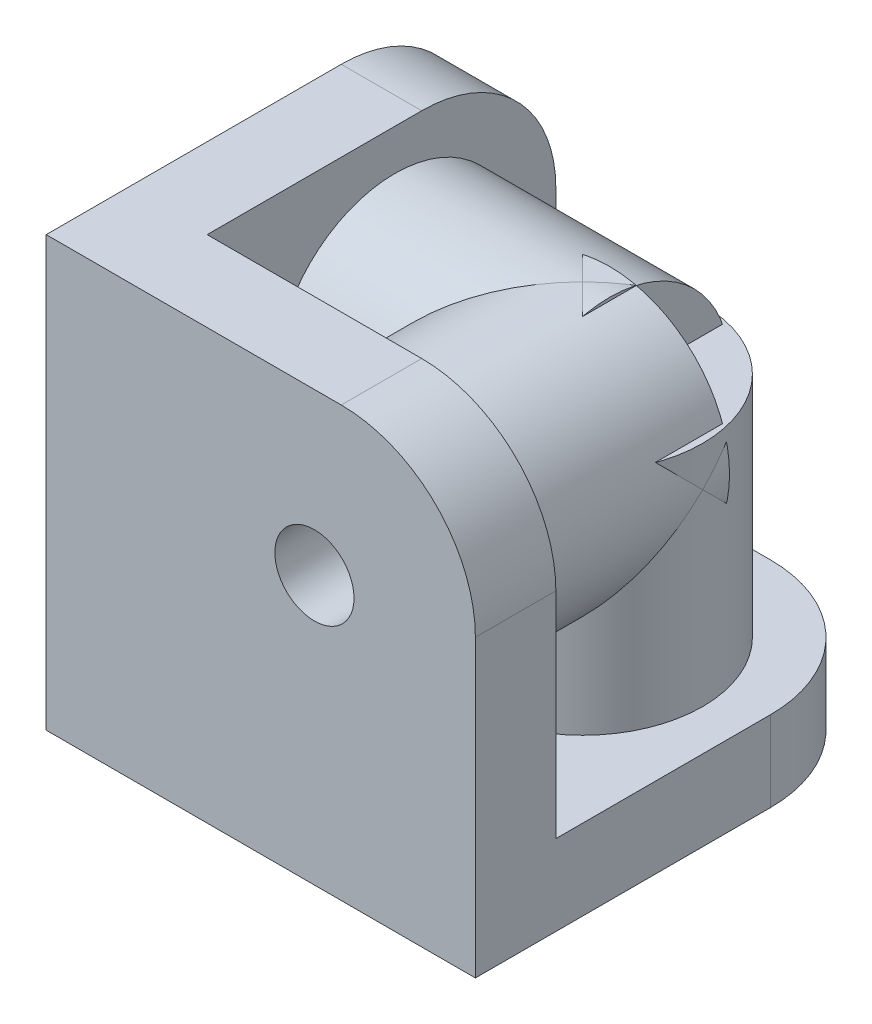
ISO-10303-21;
HEADER;
FILE_DESCRIPTION(('STEP AP214'),'2;1');
FILE_NAME('part.step','',(''),(''),'','','');
FILE_SCHEMA(('AUTOMOTIVE_DESIGN { 1 0 10303 214 1 1 1 1 }'));
ENDSEC;
DATA;
#1=APPLICATION_CONTEXT('core data for automotive mechanical design processes');
#2=APPLICATION_PROTOCOL_DEFINITION('international standard','automotive_design',2000,#1);
#3=PRODUCT_CONTEXT('',#1,'mechanical');
#4=PRODUCT('Part','Part','',(#3));
#5=PRODUCT_RELATED_PRODUCT_CATEGORY('part','',(#4));
#6=PRODUCT_DEFINITION_FORMATION('','',#4);
#7=PRODUCT_DEFINITION_CONTEXT('part definition',#1,'design');
#8=PRODUCT_DEFINITION('design','',#6,#7);
#9=PRODUCT_DEFINITION_SHAPE('','',#8);
#10=(LENGTH_UNIT() NAMED_UNIT(*) SI_UNIT(.MILLI.,.METRE.));
#11=(NAMED_UNIT(*) PLANE_ANGLE_UNIT() SI_UNIT($,.RADIAN.));
#12=(NAMED_UNIT(*) SI_UNIT($,.STERADIAN.) SOLID_ANGLE_UNIT());
#13=UNCERTAINTY_MEASURE_WITH_UNIT(LENGTH_MEASURE(1.E-05),#10,'distance_accuracy_value','');
#14=(GEOMETRIC_REPRESENTATION_CONTEXT(3) GLOBAL_UNCERTAINTY_ASSIGNED_CONTEXT((#13)) GLOBAL_UNIT_ASSIGNED_CONTEXT((#10,
#11,#12)) REPRESENTATION_CONTEXT('',''));
#15=CARTESIAN_POINT('',(0.,0.,0.));
#16=DIRECTION('',(0.,0.,1.));
#17=DIRECTION('',(1.,0.,0.));
#18=AXIS2_PLACEMENT_3D('',#15,#16,#17);
#19=CARTESIAN_POINT('',(0.,16.,-16.));
#20=DIRECTION('',(0.,1.,0.));
#21=DIRECTION('',(0.,0.,1.));
#22=AXIS2_PLACEMENT_3D('',#19,#20,#21);
#23=PLANE('',#22);
#24=DIRECTION('',(0.,0.,1.));
#25=VECTOR('',#24,1.);
#26=CARTESIAN_POINT('',(3.,16.,-16.));
#27=LINE('',#26,#25);
#28=CARTESIAN_POINT('',(3.,16.,-11.));
#29=VERTEX_POINT('',#28);
#30=CARTESIAN_POINT('',(3.,16.,-3.));
#31=VERTEX_POINT('',#30);
#32=EDGE_CURVE('E134',#29,#31,#27,.T.);
#33=ORIENTED_EDGE('',*,*,#32,.F.);
#34=DIRECTION('',(-1.,0.,0.));
#35=VECTOR('',#34,1.);
#36=CARTESIAN_POINT('',(0.,16.,-11.));
#37=LINE('',#36,#35);
#38=CARTESIAN_POINT('',(0.,16.,-11.));
#39=VERTEX_POINT('',#38);
#40=EDGE_CURVE('E205',#29,#39,#37,.T.);
#41=ORIENTED_EDGE('',*,*,#40,.T.);
#42=DIRECTION('',(0.,0.,1.));
#43=VECTOR('',#42,1.);
#44=CARTESIAN_POINT('',(0.,16.,-16.));
#45=LINE('',#44,#43);
#46=CARTESIAN_POINT('',(0.,16.,0.));
#47=VERTEX_POINT('',#46);
#48=EDGE_CURVE('E197',#39,#47,#45,.T.);
#49=ORIENTED_EDGE('',*,*,#48,.T.);
#50=DIRECTION('',(-1.,0.,0.));
#51=VECTOR('',#50,1.);
#52=CARTESIAN_POINT('',(0.,16.,0.));
#53=LINE('',#52,#51);
#54=CARTESIAN_POINT('',(11.,16.,0.));
#55=VERTEX_POINT('',#54);
#56=EDGE_CURVE('E185',#55,#47,#53,.T.);
#57=ORIENTED_EDGE('',*,*,#56,.F.);
#58=DIRECTION('',(0.,0.,1.));
#59=VECTOR('',#58,1.);
#60=CARTESIAN_POINT('',(11.,16.,-16.));
#61=LINE('',#60,#59);
#62=CARTESIAN_POINT('',(11.,16.,-3.));
#63=VERTEX_POINT('',#62);
#64=EDGE_CURVE('E200',#55,#63,#61,.F.);
#65=ORIENTED_EDGE('',*,*,#64,.T.);
#66=DIRECTION('',(-1.,0.,0.));
#67=VECTOR('',#66,1.);
#68=CARTESIAN_POINT('',(0.,16.,-3.));
#69=LINE('',#68,#67);
#70=EDGE_CURVE('E157',#63,#31,#69,.T.);
#71=ORIENTED_EDGE('',*,*,#70,.T.);
#72=EDGE_LOOP('',(#33,#41,#49,#57,#65,#71));
#73=FACE_BOUND('',#72,.T.);
#74=ADVANCED_FACE('F33',(#73),#23,.T.);
#75=CARTESIAN_POINT('',(16.,0.,-16.));
#76=DIRECTION('',(1.,0.,0.));
#77=DIRECTION('',(0.,0.,-1.));
#78=AXIS2_PLACEMENT_3D('',#75,#76,#77);
#79=PLANE('',#78);
#80=DIRECTION('',(0.,0.,1.));
#81=VECTOR('',#80,1.);
#82=CARTESIAN_POINT('',(16.,0.,-16.));
#83=LINE('',#82,#81);
#84=CARTESIAN_POINT('',(16.,0.,-11.));
#85=VERTEX_POINT('',#84);
#86=CARTESIAN_POINT('',(16.,0.,0.));
#87=VERTEX_POINT('',#86);
#88=EDGE_CURVE('E201',#85,#87,#83,.T.);
#89=ORIENTED_EDGE('',*,*,#88,.F.);
#90=DIRECTION('',(0.,1.,0.));
#91=VECTOR('',#90,1.);
#92=CARTESIAN_POINT('',(16.,0.,-11.));
#93=LINE('',#92,#91);
#94=CARTESIAN_POINT('',(16.,3.,-11.));
#95=VERTEX_POINT('',#94);
#96=EDGE_CURVE('E218',#85,#95,#93,.T.);
#97=ORIENTED_EDGE('',*,*,#96,.T.);
#98=DIRECTION('',(0.,0.,1.));
#99=VECTOR('',#98,1.);
#100=CARTESIAN_POINT('',(16.,3.,-16.));
#101=LINE('',#100,#99);
#102=CARTESIAN_POINT('',(16.,3.,-3.));
#103=VERTEX_POINT('',#102);
#104=EDGE_CURVE('E121',#95,#103,#101,.T.);
#105=ORIENTED_EDGE('',*,*,#104,.T.);
#106=DIRECTION('',(0.,1.,0.));
#107=VECTOR('',#106,1.);
#108=CARTESIAN_POINT('',(16.,0.,-3.));
#109=LINE('',#108,#107);
#110=CARTESIAN_POINT('',(16.,11.,-3.));
#111=VERTEX_POINT('',#110);
#112=EDGE_CURVE('E130',#103,#111,#109,.T.);
#113=ORIENTED_EDGE('',*,*,#112,.T.);
#114=DIRECTION('',(0.,0.,1.));
#115=VECTOR('',#114,1.);
#116=CARTESIAN_POINT('',(16.,11.,-16.));
#117=LINE('',#116,#115);
#118=CARTESIAN_POINT('',(16.,11.,0.));
#119=VERTEX_POINT('',#118);
#120=EDGE_CURVE('E216',#111,#119,#117,.T.);
#121=ORIENTED_EDGE('',*,*,#120,.T.);
#122=DIRECTION('',(0.,1.,0.));
#123=VECTOR('',#122,1.);
#124=CARTESIAN_POINT('',(16.,0.,0.));
#125=LINE('',#124,#123);
#126=EDGE_CURVE('E193',#87,#119,#125,.T.);
#127=ORIENTED_EDGE('',*,*,#126,.F.);
#128=EDGE_LOOP('',(#89,#97,#105,#113,#121,#127));
#129=FACE_BOUND('',#128,.T.);
#130=ADVANCED_FACE('F232',(#129),#79,.T.);
#131=CARTESIAN_POINT('',(0.,0.,-16.));
#132=DIRECTION('',(0.,0.,-1.));
#133=DIRECTION('',(-1.,0.,0.));
#134=AXIS2_PLACEMENT_3D('',#131,#132,#133);
#135=PLANE('',#134);
#136=DIRECTION('',(0.,-1.,0.));
#137=VECTOR('',#136,1.);
#138=CARTESIAN_POINT('',(0.,0.,-16.));
#139=LINE('',#138,#137);
#140=CARTESIAN_POINT('',(0.,11.,-16.));
#141=VERTEX_POINT('',#140);
#142=CARTESIAN_POINT('',(0.,0.,-16.));
#143=VERTEX_POINT('',#142);
#144=EDGE_CURVE('E182',#141,#143,#139,.T.);
#145=ORIENTED_EDGE('',*,*,#144,.F.);
#146=DIRECTION('',(-1.,0.,0.));
#147=VECTOR('',#146,1.);
#148=CARTESIAN_POINT('',(0.,11.,-16.));
#149=LINE('',#148,#147);
#150=CARTESIAN_POINT('',(3.,11.,-16.));
#151=VERTEX_POINT('',#150);
#152=EDGE_CURVE('E212',#141,#151,#149,.F.);
#153=ORIENTED_EDGE('',*,*,#152,.T.);
#154=DIRECTION('',(0.,-1.,0.));
#155=VECTOR('',#154,1.);
#156=CARTESIAN_POINT('',(3.,0.,-16.));
#157=LINE('',#156,#155);
#158=CARTESIAN_POINT('',(3.,3.,-16.));
#159=VERTEX_POINT('',#158);
#160=EDGE_CURVE('E159',#151,#159,#157,.T.);
#161=ORIENTED_EDGE('',*,*,#160,.T.);
#162=DIRECTION('',(1.,0.,0.));
#163=VECTOR('',#162,1.);
#164=CARTESIAN_POINT('',(0.,3.,-16.));
#165=LINE('',#164,#163);
#166=CARTESIAN_POINT('',(11.,3.,-16.));
#167=VERTEX_POINT('',#166);
#168=EDGE_CURVE('E117',#159,#167,#165,.T.);
#169=ORIENTED_EDGE('',*,*,#168,.T.);
#170=DIRECTION('',(0.,1.,0.));
#171=VECTOR('',#170,1.);
#172=CARTESIAN_POINT('',(11.,0.,-16.));
#173=LINE('',#172,#171);
#174=CARTESIAN_POINT('',(11.,0.,-16.));
#175=VERTEX_POINT('',#174);
#176=EDGE_CURVE('E210',#167,#175,#173,.F.);
#177=ORIENTED_EDGE('',*,*,#176,.T.);
#178=DIRECTION('',(1.,0.,0.));
#179=VECTOR('',#178,1.);
#180=CARTESIAN_POINT('',(0.,0.,-16.));
#181=LINE('',#180,#179);
#182=EDGE_CURVE('E184',#143,#175,#181,.T.);
#183=ORIENTED_EDGE('',*,*,#182,.F.);
#184=EDGE_LOOP('',(#145,#153,#161,#169,#177,#183));
#185=FACE_BOUND('',#184,.T.);
#186=ADVANCED_FACE('F238',(#185),#135,.T.);
#187=CARTESIAN_POINT('',(0.,0.,-16.));
#188=DIRECTION('',(-1.,0.,0.));
#189=DIRECTION('',(0.,0.,1.));
#190=AXIS2_PLACEMENT_3D('',#187,#188,#189);
#191=PLANE('',#190);
#192=CARTESIAN_POINT('',(0.,10.,-10.));
#193=DIRECTION('',(-1.,0.,0.));
#194=DIRECTION('',(0.,0.,1.));
#195=AXIS2_PLACEMENT_3D('',#192,#193,#194);
#196=CIRCLE('',#195,1.475);
#197=CARTESIAN_POINT('',(0.,10.,-8.525));
#198=VERTEX_POINT('',#197);
#199=EDGE_CURVE('E167',#198,#198,#196,.T.);
#200=ORIENTED_EDGE('',*,*,#199,.F.);
#201=EDGE_LOOP('',(#200));
#202=FACE_BOUND('',#201,.T.);
#203=ORIENTED_EDGE('',*,*,#48,.F.);
#204=CARTESIAN_POINT('',(0.,11.,-11.));
#205=DIRECTION('',(-1.,0.,0.));
#206=DIRECTION('',(0.,0.,1.));
#207=AXIS2_PLACEMENT_3D('',#204,#205,#206);
#208=CIRCLE('',#207,5.);
#209=EDGE_CURVE('E208',#39,#141,#208,.T.);
#210=ORIENTED_EDGE('',*,*,#209,.T.);
#211=ORIENTED_EDGE('',*,*,#144,.T.);
#212=DIRECTION('',(0.,0.,1.));
#213=VECTOR('',#212,1.);
#214=CARTESIAN_POINT('',(0.,0.,-16.));
#215=LINE('',#214,#213);
#216=CARTESIAN_POINT('',(0.,0.,0.));
#217=VERTEX_POINT('',#216);
#218=EDGE_CURVE('E187',#143,#217,#215,.T.);
#219=ORIENTED_EDGE('',*,*,#218,.T.);
#220=DIRECTION('',(0.,-1.,0.));
#221=VECTOR('',#220,1.);
#222=CARTESIAN_POINT('',(0.,0.,0.));
#223=LINE('',#222,#221);
#224=EDGE_CURVE('E179',#47,#217,#223,.T.);
#225=ORIENTED_EDGE('',*,*,#224,.F.);
#226=EDGE_LOOP('',(#203,#210,#211,#219,#225));
#227=FACE_BOUND('',#226,.T.);
#228=ADVANCED_FACE('F262',(#202,#227),#191,.T.);
#229=CARTESIAN_POINT('',(0.,0.,-16.));
#230=DIRECTION('',(0.,-1.,0.));
#231=DIRECTION('',(0.,0.,-1.));
#232=AXIS2_PLACEMENT_3D('',#229,#230,#231);
#233=PLANE('',#232);
#234=CARTESIAN_POINT('',(10.,0.,-10.));
#235=DIRECTION('',(0.,-1.,0.));
#236=DIRECTION('',(0.,0.,-1.));
#237=AXIS2_PLACEMENT_3D('',#234,#235,#236);
#238=CIRCLE('',#237,1.475);
#239=CARTESIAN_POINT('',(10.,0.,-11.475));
#240=VERTEX_POINT('',#239);
#241=EDGE_CURVE('E173',#240,#240,#238,.T.);
#242=ORIENTED_EDGE('',*,*,#241,.F.);
#243=EDGE_LOOP('',(#242));
#244=FACE_BOUND('',#243,.T.);
#245=ORIENTED_EDGE('',*,*,#182,.T.);
#246=CARTESIAN_POINT('',(11.,0.,-11.));
#247=DIRECTION('',(0.,-1.,0.));
#248=DIRECTION('',(0.,0.,-1.));
#249=AXIS2_PLACEMENT_3D('',#246,#247,#248);
#250=CIRCLE('',#249,5.);
#251=EDGE_CURVE('E48',#175,#85,#250,.T.);
#252=ORIENTED_EDGE('',*,*,#251,.T.);
#253=ORIENTED_EDGE('',*,*,#88,.T.);
#254=DIRECTION('',(1.,0.,0.));
#255=VECTOR('',#254,1.);
#256=CARTESIAN_POINT('',(0.,0.,0.));
#257=LINE('',#256,#255);
#258=EDGE_CURVE('E190',#217,#87,#257,.T.);
#259=ORIENTED_EDGE('',*,*,#258,.F.);
#260=ORIENTED_EDGE('',*,*,#218,.F.);
#261=EDGE_LOOP('',(#245,#252,#253,#259,#260));
#262=FACE_BOUND('',#261,.T.);
#263=ADVANCED_FACE('F259',(#244,#262),#233,.T.);
#264=CARTESIAN_POINT('',(0.,0.,0.));
#265=DIRECTION('',(0.,0.,-1.));
#266=DIRECTION('',(-1.,0.,0.));
#267=AXIS2_PLACEMENT_3D('',#264,#265,#266);
#268=PLANE('',#267);
#269=CARTESIAN_POINT('',(10.,10.,0.));
#270=DIRECTION('',(0.,0.,1.));
#271=DIRECTION('',(1.,0.,0.));
#272=AXIS2_PLACEMENT_3D('',#269,#270,#271);
#273=CIRCLE('',#272,1.475);
#274=CARTESIAN_POINT('',(11.475,10.,0.));
#275=VERTEX_POINT('',#274);
#276=EDGE_CURVE('E156',#275,#275,#273,.T.);
#277=ORIENTED_EDGE('',*,*,#276,.F.);
#278=EDGE_LOOP('',(#277));
#279=FACE_BOUND('',#278,.T.);
#280=ORIENTED_EDGE('',*,*,#126,.T.);
#281=CARTESIAN_POINT('',(11.,11.,0.));
#282=DIRECTION('',(0.,0.,-1.));
#283=DIRECTION('',(-1.,0.,0.));
#284=AXIS2_PLACEMENT_3D('',#281,#282,#283);
#285=CIRCLE('',#284,5.);
#286=EDGE_CURVE('E41',#119,#55,#285,.F.);
#287=ORIENTED_EDGE('',*,*,#286,.T.);
#288=ORIENTED_EDGE('',*,*,#56,.T.);
#289=ORIENTED_EDGE('',*,*,#224,.T.);
#290=ORIENTED_EDGE('',*,*,#258,.T.);
#291=EDGE_LOOP('',(#280,#287,#288,#289,#290));
#292=FACE_BOUND('',#291,.T.);
#293=ADVANCED_FACE('F225',(#279,#292),#268,.F.);
#294=CARTESIAN_POINT('',(10.,8.5,-10.));
#295=DIRECTION('',(0.,-1.,0.));
#296=DIRECTION('',(0.,0.,-1.));
#297=AXIS2_PLACEMENT_3D('',#294,#295,#296);
#298=CYLINDRICAL_SURFACE('',#297,1.475);
#299=CARTESIAN_POINT('',(10.,8.5,-10.));
#300=DIRECTION('',(0.,-1.,0.));
#301=DIRECTION('',(0.,0.,-1.));
#302=AXIS2_PLACEMENT_3D('',#299,#300,#301);
#303=CIRCLE('',#302,1.475);
#304=CARTESIAN_POINT('',(10.,8.5,-11.475));
#305=VERTEX_POINT('',#304);
#306=EDGE_CURVE('E176',#305,#305,#303,.T.);
#307=ORIENTED_EDGE('',*,*,#306,.F.);
#308=EDGE_LOOP('',(#307));
#309=FACE_BOUND('',#308,.T.);
#310=ORIENTED_EDGE('',*,*,#241,.T.);
#311=EDGE_LOOP('',(#310));
#312=FACE_BOUND('',#311,.T.);
#313=ADVANCED_FACE('F290',(#309,#312),#298,.F.);
#314=CARTESIAN_POINT('',(10.,8.5,-10.));
#315=DIRECTION('',(0.,-1.,0.));
#316=DIRECTION('',(0.,0.,-1.));
#317=AXIS2_PLACEMENT_3D('',#314,#315,#316);
#318=PLANE('',#317);
#319=ORIENTED_EDGE('',*,*,#306,.T.);
#320=EDGE_LOOP('',(#319));
#321=FACE_BOUND('',#320,.T.);
#322=ADVANCED_FACE('F280',(#321),#318,.T.);
#323=CARTESIAN_POINT('',(8.,10.,-10.));
#324=DIRECTION('',(-1.,0.,0.));
#325=DIRECTION('',(0.,0.,1.));
#326=AXIS2_PLACEMENT_3D('',#323,#324,#325);
#327=CYLINDRICAL_SURFACE('',#326,1.475);
#328=CARTESIAN_POINT('',(8.,10.,-10.));
#329=DIRECTION('',(-1.,0.,0.));
#330=DIRECTION('',(0.,0.,1.));
#331=AXIS2_PLACEMENT_3D('',#328,#329,#330);
#332=CIRCLE('',#331,1.475);
#333=CARTESIAN_POINT('',(8.,10.,-8.525));
#334=VERTEX_POINT('',#333);
#335=EDGE_CURVE('E170',#334,#334,#332,.T.);
#336=ORIENTED_EDGE('',*,*,#335,.F.);
#337=EDGE_LOOP('',(#336));
#338=FACE_BOUND('',#337,.T.);
#339=ORIENTED_EDGE('',*,*,#199,.T.);
#340=EDGE_LOOP('',(#339));
#341=FACE_BOUND('',#340,.T.);
#342=ADVANCED_FACE('F277',(#338,#341),#327,.F.);
#343=CARTESIAN_POINT('',(8.,10.,-10.));
#344=DIRECTION('',(-1.,0.,0.));
#345=DIRECTION('',(0.,0.,1.));
#346=AXIS2_PLACEMENT_3D('',#343,#344,#345);
#347=PLANE('',#346);
#348=ORIENTED_EDGE('',*,*,#335,.T.);
#349=EDGE_LOOP('',(#348));
#350=FACE_BOUND('',#349,.T.);
#351=ADVANCED_FACE('F279',(#350),#347,.T.);
#352=CARTESIAN_POINT('',(10.,10.,-8.));
#353=DIRECTION('',(0.,0.,1.));
#354=DIRECTION('',(1.,0.,0.));
#355=AXIS2_PLACEMENT_3D('',#352,#353,#354);
#356=CYLINDRICAL_SURFACE('',#355,1.475);
#357=CARTESIAN_POINT('',(10.,10.,-8.));
#358=DIRECTION('',(0.,0.,1.));
#359=DIRECTION('',(1.,0.,0.));
#360=AXIS2_PLACEMENT_3D('',#357,#358,#359);
#361=CIRCLE('',#360,1.475);
#362=CARTESIAN_POINT('',(11.475,10.,-8.));
#363=VERTEX_POINT('',#362);
#364=EDGE_CURVE('E164',#363,#363,#361,.T.);
#365=ORIENTED_EDGE('',*,*,#364,.F.);
#366=EDGE_LOOP('',(#365));
#367=FACE_BOUND('',#366,.T.);
#368=ORIENTED_EDGE('',*,*,#276,.T.);
#369=EDGE_LOOP('',(#368));
#370=FACE_BOUND('',#369,.T.);
#371=ADVANCED_FACE('F287',(#367,#370),#356,.F.);
#372=CARTESIAN_POINT('',(10.,10.,-8.));
#373=DIRECTION('',(0.,0.,1.));
#374=DIRECTION('',(1.,0.,0.));
#375=AXIS2_PLACEMENT_3D('',#372,#373,#374);
#376=PLANE('',#375);
#377=ORIENTED_EDGE('',*,*,#364,.T.);
#378=EDGE_LOOP('',(#377));
#379=FACE_BOUND('',#378,.T.);
#380=ADVANCED_FACE('F310',(#379),#376,.T.);
#381=CARTESIAN_POINT('',(3.,0.,-16.));
#382=DIRECTION('',(-1.,0.,0.));
#383=DIRECTION('',(0.,0.,1.));
#384=AXIS2_PLACEMENT_3D('',#381,#382,#383);
#385=PLANE('',#384);
#386=CARTESIAN_POINT('',(3.,10.,-10.));
#387=DIRECTION('',(-1.,0.,0.));
#388=DIRECTION('',(0.,0.,1.));
#389=AXIS2_PLACEMENT_3D('',#386,#387,#388);
#390=CIRCLE('',#389,4.475);
#391=CARTESIAN_POINT('',(3.,10.,-5.525));
#392=VERTEX_POINT('',#391);
#393=EDGE_CURVE('E142',#392,#392,#390,.T.);
#394=ORIENTED_EDGE('',*,*,#393,.T.);
#395=EDGE_LOOP('',(#394));
#396=FACE_BOUND('',#395,.T.);
#397=ORIENTED_EDGE('',*,*,#160,.F.);
#398=CARTESIAN_POINT('',(3.,11.,-11.));
#399=DIRECTION('',(-1.,0.,0.));
#400=DIRECTION('',(0.,0.,1.));
#401=AXIS2_PLACEMENT_3D('',#398,#399,#400);
#402=CIRCLE('',#401,5.);
#403=EDGE_CURVE('E214',#151,#29,#402,.F.);
#404=ORIENTED_EDGE('',*,*,#403,.T.);
#405=ORIENTED_EDGE('',*,*,#32,.T.);
#406=DIRECTION('',(0.,-1.,0.));
#407=VECTOR('',#406,1.);
#408=CARTESIAN_POINT('',(3.,0.,-3.));
#409=LINE('',#408,#407);
#410=CARTESIAN_POINT('',(3.,3.,-3.));
#411=VERTEX_POINT('',#410);
#412=EDGE_CURVE('E128',#31,#411,#409,.T.);
#413=ORIENTED_EDGE('',*,*,#412,.T.);
#414=DIRECTION('',(0.,0.,1.));
#415=VECTOR('',#414,1.);
#416=CARTESIAN_POINT('',(3.,3.,-16.));
#417=LINE('',#416,#415);
#418=EDGE_CURVE('E111',#159,#411,#417,.T.);
#419=ORIENTED_EDGE('',*,*,#418,.F.);
#420=EDGE_LOOP('',(#397,#404,#405,#413,#419));
#421=FACE_BOUND('',#420,.T.);
#422=ADVANCED_FACE('F132',(#396,#421),#385,.F.);
#423=CARTESIAN_POINT('',(0.,3.,-16.));
#424=DIRECTION('',(0.,-1.,0.));
#425=DIRECTION('',(0.,0.,-1.));
#426=AXIS2_PLACEMENT_3D('',#423,#424,#425);
#427=PLANE('',#426);
#428=CARTESIAN_POINT('',(10.,3.,-10.));
#429=DIRECTION('',(0.,-1.,0.));
#430=DIRECTION('',(0.,0.,-1.));
#431=AXIS2_PLACEMENT_3D('',#428,#429,#430);
#432=CIRCLE('',#431,4.475);
#433=CARTESIAN_POINT('',(10.,3.,-14.475));
#434=VERTEX_POINT('',#433);
#435=EDGE_CURVE('E139',#434,#434,#432,.T.);
#436=ORIENTED_EDGE('',*,*,#435,.T.);
#437=EDGE_LOOP('',(#436));
#438=FACE_BOUND('',#437,.T.);
#439=ORIENTED_EDGE('',*,*,#104,.F.);
#440=CARTESIAN_POINT('',(11.,3.,-11.));
#441=DIRECTION('',(0.,-1.,0.));
#442=DIRECTION('',(0.,0.,-1.));
#443=AXIS2_PLACEMENT_3D('',#440,#441,#442);
#444=CIRCLE('',#443,5.);
#445=EDGE_CURVE('E221',#95,#167,#444,.F.);
#446=ORIENTED_EDGE('',*,*,#445,.T.);
#447=ORIENTED_EDGE('',*,*,#168,.F.);
#448=ORIENTED_EDGE('',*,*,#418,.T.);
#449=DIRECTION('',(1.,0.,0.));
#450=VECTOR('',#449,1.);
#451=CARTESIAN_POINT('',(0.,3.,-3.));
#452=LINE('',#451,#450);
#453=EDGE_CURVE('E115',#411,#103,#452,.T.);
#454=ORIENTED_EDGE('',*,*,#453,.T.);
#455=EDGE_LOOP('',(#439,#446,#447,#448,#454));
#456=FACE_BOUND('',#455,.T.);
#457=ADVANCED_FACE('F114',(#438,#456),#427,.F.);
#458=CARTESIAN_POINT('',(0.,0.,-3.));
#459=DIRECTION('',(0.,0.,-1.));
#460=DIRECTION('',(-1.,0.,0.));
#461=AXIS2_PLACEMENT_3D('',#458,#459,#460);
#462=PLANE('',#461);
#463=CARTESIAN_POINT('',(10.,10.,-3.));
#464=DIRECTION('',(0.,0.,-1.));
#465=DIRECTION('',(-1.,0.,0.));
#466=AXIS2_PLACEMENT_3D('',#463,#464,#465);
#467=CIRCLE('',#466,4.475);
#468=CARTESIAN_POINT('',(5.525,10.,-3.));
#469=VERTEX_POINT('',#468);
#470=EDGE_CURVE('E147',#469,#469,#467,.F.);
#471=ORIENTED_EDGE('',*,*,#470,.T.);
#472=EDGE_LOOP('',(#471));
#473=FACE_BOUND('',#472,.T.);
#474=ORIENTED_EDGE('',*,*,#70,.F.);
#475=CARTESIAN_POINT('',(11.,11.,-3.));
#476=DIRECTION('',(0.,0.,-1.));
#477=DIRECTION('',(-1.,0.,0.));
#478=AXIS2_PLACEMENT_3D('',#475,#476,#477);
#479=CIRCLE('',#478,5.);
#480=EDGE_CURVE('E11',#63,#111,#479,.T.);
#481=ORIENTED_EDGE('',*,*,#480,.T.);
#482=ORIENTED_EDGE('',*,*,#112,.F.);
#483=ORIENTED_EDGE('',*,*,#453,.F.);
#484=ORIENTED_EDGE('',*,*,#412,.F.);
#485=EDGE_LOOP('',(#474,#481,#482,#483,#484));
#486=FACE_BOUND('',#485,.T.);
#487=ADVANCED_FACE('F127',(#473,#486),#462,.T.);
#488=CARTESIAN_POINT('',(10.,8.5,-10.));
#489=DIRECTION('',(0.,-1.,0.));
#490=DIRECTION('',(0.,0.,-1.));
#491=AXIS2_PLACEMENT_3D('',#488,#489,#490);
#492=CYLINDRICAL_SURFACE('',#491,4.475);
#493=CARTESIAN_POINT('',(10.,11.5,-10.));
#494=DIRECTION('',(0.,-1.,0.));
#495=DIRECTION('',(0.,0.,-1.));
#496=AXIS2_PLACEMENT_3D('',#493,#494,#495);
#497=CIRCLE('',#496,4.475);
#498=CARTESIAN_POINT('',(10.,11.5,-14.475));
#499=VERTEX_POINT('',#498);
#500=EDGE_CURVE('E136',#499,#499,#497,.T.);
#501=ORIENTED_EDGE('',*,*,#500,.T.);
#502=EDGE_LOOP('',(#501));
#503=FACE_BOUND('',#502,.T.);
#504=ORIENTED_EDGE('',*,*,#435,.F.);
#505=EDGE_LOOP('',(#504));
#506=FACE_BOUND('',#505,.T.);
#507=ADVANCED_FACE('F337',(#503,#506),#492,.T.);
#508=CARTESIAN_POINT('',(10.,11.5,-10.));
#509=DIRECTION('',(0.,-1.,0.));
#510=DIRECTION('',(0.,0.,-1.));
#511=AXIS2_PLACEMENT_3D('',#508,#509,#510);
#512=PLANE('',#511);
#513=ORIENTED_EDGE('',*,*,#500,.F.);
#514=EDGE_LOOP('',(#513));
#515=FACE_BOUND('',#514,.T.);
#516=ADVANCED_FACE('F333',(#515),#512,.F.);
#517=CARTESIAN_POINT('',(8.,10.,-10.));
#518=DIRECTION('',(-1.,0.,0.));
#519=DIRECTION('',(0.,0.,1.));
#520=AXIS2_PLACEMENT_3D('',#517,#518,#519);
#521=CYLINDRICAL_SURFACE('',#520,4.475);
#522=CARTESIAN_POINT('',(11.,10.,-10.));
#523=DIRECTION('',(-1.,0.,0.));
#524=DIRECTION('',(0.,0.,1.));
#525=AXIS2_PLACEMENT_3D('',#522,#523,#524);
#526=CIRCLE('',#525,4.475);
#527=CARTESIAN_POINT('',(11.,10.,-5.525));
#528=VERTEX_POINT('',#527);
#529=EDGE_CURVE('E145',#528,#528,#526,.T.);
#530=ORIENTED_EDGE('',*,*,#529,.T.);
#531=EDGE_LOOP('',(#530));
#532=FACE_BOUND('',#531,.T.);
#533=ORIENTED_EDGE('',*,*,#393,.F.);
#534=EDGE_LOOP('',(#533));
#535=FACE_BOUND('',#534,.T.);
#536=ADVANCED_FACE('F329',(#532,#535),#521,.T.);
#537=CARTESIAN_POINT('',(11.,10.,-10.));
#538=DIRECTION('',(-1.,0.,0.));
#539=DIRECTION('',(0.,0.,1.));
#540=AXIS2_PLACEMENT_3D('',#537,#538,#539);
#541=PLANE('',#540);
#542=ORIENTED_EDGE('',*,*,#529,.F.);
#543=EDGE_LOOP('',(#542));
#544=FACE_BOUND('',#543,.T.);
#545=ADVANCED_FACE('F325',(#544),#541,.F.);
#546=CARTESIAN_POINT('',(10.,10.,-8.));
#547=DIRECTION('',(0.,0.,1.));
#548=DIRECTION('',(1.,0.,0.));
#549=AXIS2_PLACEMENT_3D('',#546,#547,#548);
#550=CYLINDRICAL_SURFACE('',#549,4.475);
#551=CARTESIAN_POINT('',(10.,10.,-11.));
#552=DIRECTION('',(0.,0.,1.));
#553=DIRECTION('',(1.,0.,0.));
#554=AXIS2_PLACEMENT_3D('',#551,#552,#553);
#555=CIRCLE('',#554,4.475);
#556=CARTESIAN_POINT('',(14.475,10.,-11.));
#557=VERTEX_POINT('',#556);
#558=EDGE_CURVE('E150',#557,#557,#555,.T.);
#559=ORIENTED_EDGE('',*,*,#558,.T.);
#560=EDGE_LOOP('',(#559));
#561=FACE_BOUND('',#560,.T.);
#562=ORIENTED_EDGE('',*,*,#470,.F.);
#563=EDGE_LOOP('',(#562));
#564=FACE_BOUND('',#563,.T.);
#565=ADVANCED_FACE('F321',(#561,#564),#550,.T.);
#566=CARTESIAN_POINT('',(10.,10.,-11.));
#567=DIRECTION('',(0.,0.,1.));
#568=DIRECTION('',(1.,0.,0.));
#569=AXIS2_PLACEMENT_3D('',#566,#567,#568);
#570=PLANE('',#569);
#571=ORIENTED_EDGE('',*,*,#558,.F.);
#572=EDGE_LOOP('',(#571));
#573=FACE_BOUND('',#572,.T.);
#574=ADVANCED_FACE('F247',(#573),#570,.F.);
#575=CARTESIAN_POINT('',(0.,11.,-11.));
#576=DIRECTION('',(-1.,0.,0.));
#577=DIRECTION('',(0.,0.,1.));
#578=AXIS2_PLACEMENT_3D('',#575,#576,#577);
#579=CYLINDRICAL_SURFACE('',#578,5.);
#580=ORIENTED_EDGE('',*,*,#403,.F.);
#581=ORIENTED_EDGE('',*,*,#152,.F.);
#582=ORIENTED_EDGE('',*,*,#209,.F.);
#583=ORIENTED_EDGE('',*,*,#40,.F.);
#584=EDGE_LOOP('',(#580,#581,#582,#583));
#585=FACE_BOUND('',#584,.T.);
#586=ADVANCED_FACE('F242',(#585),#579,.T.);
#587=CARTESIAN_POINT('',(11.,0.,-11.));
#588=DIRECTION('',(0.,1.,0.));
#589=DIRECTION('',(0.,0.,1.));
#590=AXIS2_PLACEMENT_3D('',#587,#588,#589);
#591=CYLINDRICAL_SURFACE('',#590,5.);
#592=ORIENTED_EDGE('',*,*,#251,.F.);
#593=ORIENTED_EDGE('',*,*,#176,.F.);
#594=ORIENTED_EDGE('',*,*,#445,.F.);
#595=ORIENTED_EDGE('',*,*,#96,.F.);
#596=EDGE_LOOP('',(#592,#593,#594,#595));
#597=FACE_BOUND('',#596,.T.);
#598=ADVANCED_FACE('F240',(#597),#591,.T.);
#599=CARTESIAN_POINT('',(11.,11.,-16.));
#600=DIRECTION('',(0.,0.,1.));
#601=DIRECTION('',(1.,0.,0.));
#602=AXIS2_PLACEMENT_3D('',#599,#600,#601);
#603=CYLINDRICAL_SURFACE('',#602,5.);
#604=ORIENTED_EDGE('',*,*,#480,.F.);
#605=ORIENTED_EDGE('',*,*,#64,.F.);
#606=ORIENTED_EDGE('',*,*,#286,.F.);
#607=ORIENTED_EDGE('',*,*,#120,.F.);
#608=EDGE_LOOP('',(#604,#605,#606,#607));
#609=FACE_BOUND('',#608,.T.);
#610=ADVANCED_FACE('F35',(#609),#603,.T.);
#611=CLOSED_SHELL('',(#74,#130,#186,#228,#263,#293,#313,#322,#342,#351,#371,#380,#422,#457,#487,
#507,#516,#536,#545,#565,#574,#586,#598,#610));
#612=MANIFOLD_SOLID_BREP('B2',#611);
#613=ADVANCED_BREP_SHAPE_REPRESENTATION('',(#18,#612),#14);
#614=SHAPE_DEFINITION_REPRESENTATION(#9,#613);
ENDSEC;
END-ISO-10303-21;
